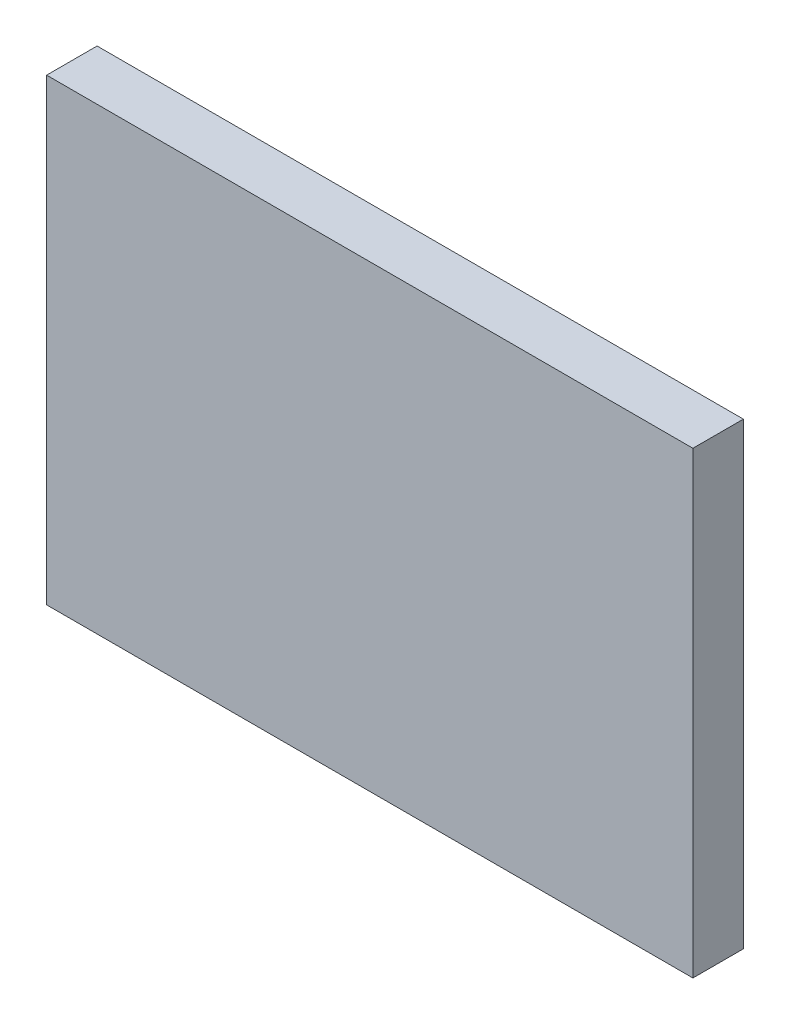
ISO-10303-21;
HEADER;
FILE_DESCRIPTION(('STEP AP214'),'2;1');
FILE_NAME('part.step','',(''),(''),'','','');
FILE_SCHEMA(('AUTOMOTIVE_DESIGN { 1 0 10303 214 1 1 1 1 }'));
ENDSEC;
DATA;
#1=APPLICATION_CONTEXT('core data for automotive mechanical design processes');
#2=APPLICATION_PROTOCOL_DEFINITION('international standard','automotive_design',2000,#1);
#3=PRODUCT_CONTEXT('',#1,'mechanical');
#4=PRODUCT('Part','Part','',(#3));
#5=PRODUCT_RELATED_PRODUCT_CATEGORY('part','',(#4));
#6=PRODUCT_DEFINITION_FORMATION('','',#4);
#7=PRODUCT_DEFINITION_CONTEXT('part definition',#1,'design');
#8=PRODUCT_DEFINITION('design','',#6,#7);
#9=PRODUCT_DEFINITION_SHAPE('','',#8);
#10=(LENGTH_UNIT() NAMED_UNIT(*) SI_UNIT(.MILLI.,.METRE.));
#11=(NAMED_UNIT(*) PLANE_ANGLE_UNIT() SI_UNIT($,.RADIAN.));
#12=(NAMED_UNIT(*) SI_UNIT($,.STERADIAN.) SOLID_ANGLE_UNIT());
#13=UNCERTAINTY_MEASURE_WITH_UNIT(LENGTH_MEASURE(1.E-05),#10,'distance_accuracy_value','');
#14=(GEOMETRIC_REPRESENTATION_CONTEXT(3) GLOBAL_UNCERTAINTY_ASSIGNED_CONTEXT((#13)) GLOBAL_UNIT_ASSIGNED_CONTEXT((#10,
#11,#12)) REPRESENTATION_CONTEXT('',''));
#15=CARTESIAN_POINT('',(0.,0.,0.));
#16=DIRECTION('',(0.,0.,1.));
#17=DIRECTION('',(1.,0.,0.));
#18=AXIS2_PLACEMENT_3D('',#15,#16,#17);
#19=CARTESIAN_POINT('',(162.,115.,12.65));
#20=DIRECTION('',(-1.,0.,0.));
#21=DIRECTION('',(0.,-1.,0.));
#22=AXIS2_PLACEMENT_3D('',#19,#20,#21);
#23=PLANE('',#22);
#24=DIRECTION('',(0.,1.,0.));
#25=VECTOR('',#24,1.);
#26=CARTESIAN_POINT('',(162.,115.,-12.65));
#27=LINE('',#26,#25);
#28=CARTESIAN_POINT('',(162.,-115.,-12.65));
#29=VERTEX_POINT('',#28);
#30=CARTESIAN_POINT('',(162.,115.,-12.65));
#31=VERTEX_POINT('',#30);
#32=EDGE_CURVE('E96',#29,#31,#27,.T.);
#33=ORIENTED_EDGE('',*,*,#32,.T.);
#34=DIRECTION('',(0.,0.,-1.));
#35=VECTOR('',#34,1.);
#36=CARTESIAN_POINT('',(162.,115.,12.65));
#37=LINE('',#36,#35);
#38=CARTESIAN_POINT('',(162.,115.,12.65));
#39=VERTEX_POINT('',#38);
#40=EDGE_CURVE('E11',#39,#31,#37,.T.);
#41=ORIENTED_EDGE('',*,*,#40,.F.);
#42=DIRECTION('',(0.,1.,0.));
#43=VECTOR('',#42,1.);
#44=CARTESIAN_POINT('',(162.,115.,12.65));
#45=LINE('',#44,#43);
#46=CARTESIAN_POINT('',(162.,-115.,12.65));
#47=VERTEX_POINT('',#46);
#48=EDGE_CURVE('E84',#47,#39,#45,.T.);
#49=ORIENTED_EDGE('',*,*,#48,.F.);
#50=DIRECTION('',(0.,0.,-1.));
#51=VECTOR('',#50,1.);
#52=CARTESIAN_POINT('',(162.,-115.,12.65));
#53=LINE('',#52,#51);
#54=EDGE_CURVE('E92',#47,#29,#53,.T.);
#55=ORIENTED_EDGE('',*,*,#54,.T.);
#56=EDGE_LOOP('',(#33,#41,#49,#55));
#57=FACE_BOUND('',#56,.T.);
#58=ADVANCED_FACE('F33',(#57),#23,.F.);
#59=CARTESIAN_POINT('',(-162.,115.,12.65));
#60=DIRECTION('',(0.,-1.,0.));
#61=DIRECTION('',(0.,0.,-1.));
#62=AXIS2_PLACEMENT_3D('',#59,#60,#61);
#63=PLANE('',#62);
#64=DIRECTION('',(-1.,0.,0.));
#65=VECTOR('',#64,1.);
#66=CARTESIAN_POINT('',(-162.,115.,-12.65));
#67=LINE('',#66,#65);
#68=CARTESIAN_POINT('',(-162.,115.,-12.65));
#69=VERTEX_POINT('',#68);
#70=EDGE_CURVE('E88',#31,#69,#67,.T.);
#71=ORIENTED_EDGE('',*,*,#70,.T.);
#72=DIRECTION('',(0.,0.,-1.));
#73=VECTOR('',#72,1.);
#74=CARTESIAN_POINT('',(-162.,115.,12.65));
#75=LINE('',#74,#73);
#76=CARTESIAN_POINT('',(-162.,115.,12.65));
#77=VERTEX_POINT('',#76);
#78=EDGE_CURVE('E41',#77,#69,#75,.T.);
#79=ORIENTED_EDGE('',*,*,#78,.F.);
#80=DIRECTION('',(-1.,0.,0.));
#81=VECTOR('',#80,1.);
#82=CARTESIAN_POINT('',(-162.,115.,12.65));
#83=LINE('',#82,#81);
#84=EDGE_CURVE('E79',#39,#77,#83,.T.);
#85=ORIENTED_EDGE('',*,*,#84,.F.);
#86=ORIENTED_EDGE('',*,*,#40,.T.);
#87=EDGE_LOOP('',(#71,#79,#85,#86));
#88=FACE_BOUND('',#87,.T.);
#89=ADVANCED_FACE('F87',(#88),#63,.F.);
#90=CARTESIAN_POINT('',(-162.,115.,12.65));
#91=DIRECTION('',(1.,0.,0.));
#92=DIRECTION('',(0.,0.,-1.));
#93=AXIS2_PLACEMENT_3D('',#90,#91,#92);
#94=PLANE('',#93);
#95=DIRECTION('',(0.,-1.,0.));
#96=VECTOR('',#95,1.);
#97=CARTESIAN_POINT('',(-162.,115.,-12.65));
#98=LINE('',#97,#96);
#99=CARTESIAN_POINT('',(-162.,-115.,-12.65));
#100=VERTEX_POINT('',#99);
#101=EDGE_CURVE('E66',#69,#100,#98,.T.);
#102=ORIENTED_EDGE('',*,*,#101,.T.);
#103=DIRECTION('',(0.,0.,-1.));
#104=VECTOR('',#103,1.);
#105=CARTESIAN_POINT('',(-162.,-115.,12.65));
#106=LINE('',#105,#104);
#107=CARTESIAN_POINT('',(-162.,-115.,12.65));
#108=VERTEX_POINT('',#107);
#109=EDGE_CURVE('E89',#108,#100,#106,.T.);
#110=ORIENTED_EDGE('',*,*,#109,.F.);
#111=DIRECTION('',(0.,-1.,0.));
#112=VECTOR('',#111,1.);
#113=CARTESIAN_POINT('',(-162.,115.,12.65));
#114=LINE('',#113,#112);
#115=EDGE_CURVE('E82',#77,#108,#114,.T.);
#116=ORIENTED_EDGE('',*,*,#115,.F.);
#117=ORIENTED_EDGE('',*,*,#78,.T.);
#118=EDGE_LOOP('',(#102,#110,#116,#117));
#119=FACE_BOUND('',#118,.T.);
#120=ADVANCED_FACE('F90',(#119),#94,.F.);
#121=CARTESIAN_POINT('',(-162.,-115.,12.65));
#122=DIRECTION('',(0.,1.,0.));
#123=DIRECTION('',(0.,0.,1.));
#124=AXIS2_PLACEMENT_3D('',#121,#122,#123);
#125=PLANE('',#124);
#126=DIRECTION('',(1.,0.,0.));
#127=VECTOR('',#126,1.);
#128=CARTESIAN_POINT('',(-162.,-115.,-12.65));
#129=LINE('',#128,#127);
#130=EDGE_CURVE('E72',#100,#29,#129,.T.);
#131=ORIENTED_EDGE('',*,*,#130,.T.);
#132=ORIENTED_EDGE('',*,*,#54,.F.);
#133=DIRECTION('',(1.,0.,0.));
#134=VECTOR('',#133,1.);
#135=CARTESIAN_POINT('',(-162.,-115.,12.65));
#136=LINE('',#135,#134);
#137=EDGE_CURVE('E49',#108,#47,#136,.T.);
#138=ORIENTED_EDGE('',*,*,#137,.F.);
#139=ORIENTED_EDGE('',*,*,#109,.T.);
#140=EDGE_LOOP('',(#131,#132,#138,#139));
#141=FACE_BOUND('',#140,.T.);
#142=ADVANCED_FACE('F103',(#141),#125,.F.);
#143=CARTESIAN_POINT('',(0.,0.,12.65));
#144=DIRECTION('',(0.,0.,1.));
#145=DIRECTION('',(1.,0.,0.));
#146=AXIS2_PLACEMENT_3D('',#143,#144,#145);
#147=PLANE('',#146);
#148=ORIENTED_EDGE('',*,*,#48,.T.);
#149=ORIENTED_EDGE('',*,*,#84,.T.);
#150=ORIENTED_EDGE('',*,*,#115,.T.);
#151=ORIENTED_EDGE('',*,*,#137,.T.);
#152=EDGE_LOOP('',(#148,#149,#150,#151));
#153=FACE_BOUND('',#152,.T.);
#154=ADVANCED_FACE('F80',(#153),#147,.T.);
#155=CARTESIAN_POINT('',(0.,0.,-12.65));
#156=DIRECTION('',(0.,0.,1.));
#157=DIRECTION('',(1.,0.,0.));
#158=AXIS2_PLACEMENT_3D('',#155,#156,#157);
#159=PLANE('',#158);
#160=ORIENTED_EDGE('',*,*,#32,.F.);
#161=ORIENTED_EDGE('',*,*,#130,.F.);
#162=ORIENTED_EDGE('',*,*,#101,.F.);
#163=ORIENTED_EDGE('',*,*,#70,.F.);
#164=EDGE_LOOP('',(#160,#161,#162,#163));
#165=FACE_BOUND('',#164,.T.);
#166=ADVANCED_FACE('F106',(#165),#159,.F.);
#167=CLOSED_SHELL('',(#58,#89,#120,#142,#154,#166));
#168=MANIFOLD_SOLID_BREP('B2',#167);
#169=ADVANCED_BREP_SHAPE_REPRESENTATION('',(#18,#168),#14);
#170=SHAPE_DEFINITION_REPRESENTATION(#9,#169);
ENDSEC;
END-ISO-10303-21;
